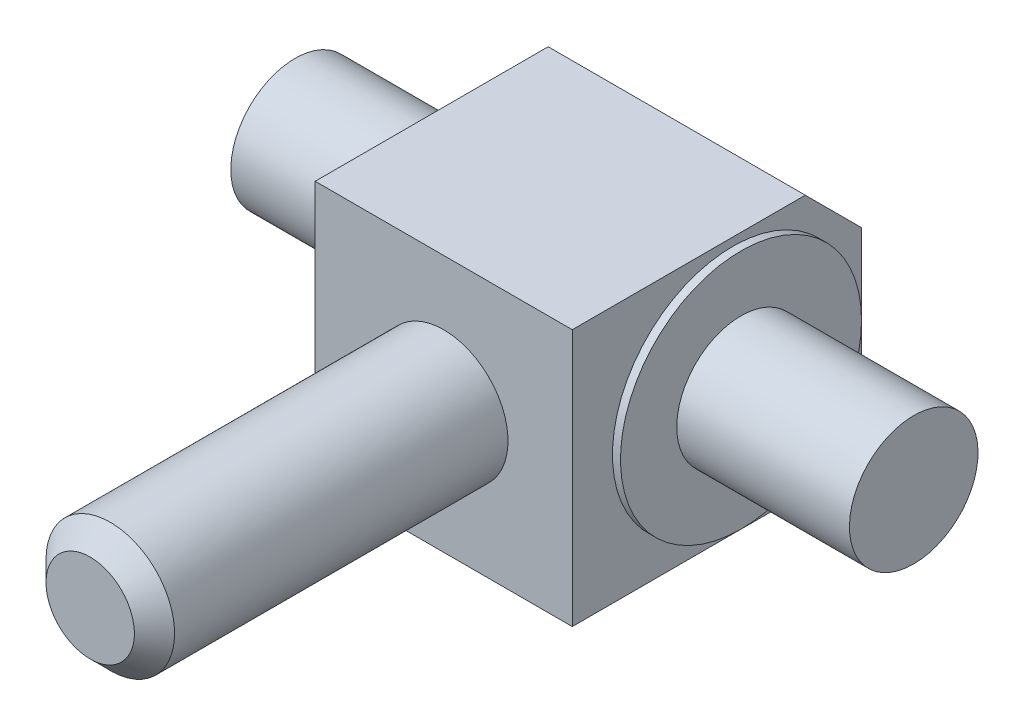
ISO-10303-21;
HEADER;
FILE_DESCRIPTION(('STEP AP214'),'2;1');
FILE_NAME('part.step','',(''),(''),'','','');
FILE_SCHEMA(('AUTOMOTIVE_DESIGN { 1 0 10303 214 1 1 1 1 }'));
ENDSEC;
DATA;
#1=APPLICATION_CONTEXT('core data for automotive mechanical design processes');
#2=APPLICATION_PROTOCOL_DEFINITION('international standard','automotive_design',2000,#1);
#3=PRODUCT_CONTEXT('',#1,'mechanical');
#4=PRODUCT('Part','Part','',(#3));
#5=PRODUCT_RELATED_PRODUCT_CATEGORY('part','',(#4));
#6=PRODUCT_DEFINITION_FORMATION('','',#4);
#7=PRODUCT_DEFINITION_CONTEXT('part definition',#1,'design');
#8=PRODUCT_DEFINITION('design','',#6,#7);
#9=PRODUCT_DEFINITION_SHAPE('','',#8);
#10=(LENGTH_UNIT() NAMED_UNIT(*) SI_UNIT(.MILLI.,.METRE.));
#11=(NAMED_UNIT(*) PLANE_ANGLE_UNIT() SI_UNIT($,.RADIAN.));
#12=(NAMED_UNIT(*) SI_UNIT($,.STERADIAN.) SOLID_ANGLE_UNIT());
#13=UNCERTAINTY_MEASURE_WITH_UNIT(LENGTH_MEASURE(1.E-05),#10,'distance_accuracy_value','');
#14=(GEOMETRIC_REPRESENTATION_CONTEXT(3) GLOBAL_UNCERTAINTY_ASSIGNED_CONTEXT((#13)) GLOBAL_UNIT_ASSIGNED_CONTEXT((#10,
#11,#12)) REPRESENTATION_CONTEXT('',''));
#15=CARTESIAN_POINT('',(0.,0.,0.));
#16=DIRECTION('',(0.,0.,1.));
#17=DIRECTION('',(1.,0.,0.));
#18=AXIS2_PLACEMENT_3D('',#15,#16,#17);
#19=CARTESIAN_POINT('',(8.,8.,-8.));
#20=DIRECTION('',(-1.,0.,0.));
#21=DIRECTION('',(0.,0.,-1.));
#22=AXIS2_PLACEMENT_3D('',#19,#20,#21);
#23=PLANE('',#22);
#24=DIRECTION('',(0.,-1.,0.));
#25=VECTOR('',#24,1.);
#26=CARTESIAN_POINT('',(8.,8.,-8.));
#27=LINE('',#26,#25);
#28=CARTESIAN_POINT('',(8.,4.5,-8.));
#29=VERTEX_POINT('',#28);
#30=CARTESIAN_POINT('',(8.,-4.5,-8.));
#31=VERTEX_POINT('',#30);
#32=EDGE_CURVE('E105',#29,#31,#27,.T.);
#33=ORIENTED_EDGE('',*,*,#32,.F.);
#34=DIRECTION('',(0.,0.707106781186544,0.707106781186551));
#35=VECTOR('',#34,1.);
#36=CARTESIAN_POINT('',(8.,8.,-4.5));
#37=LINE('',#36,#35);
#38=CARTESIAN_POINT('',(8.,8.,-4.5));
#39=VERTEX_POINT('',#38);
#40=EDGE_CURVE('E121',#29,#39,#37,.T.);
#41=ORIENTED_EDGE('',*,*,#40,.T.);
#42=DIRECTION('',(0.,0.,1.));
#43=VECTOR('',#42,1.);
#44=CARTESIAN_POINT('',(8.,8.,-8.));
#45=LINE('',#44,#43);
#46=CARTESIAN_POINT('',(8.,8.,10.));
#47=VERTEX_POINT('',#46);
#48=EDGE_CURVE('E79',#39,#47,#45,.T.);
#49=ORIENTED_EDGE('',*,*,#48,.T.);
#50=DIRECTION('',(0.,-1.,0.));
#51=VECTOR('',#50,1.);
#52=CARTESIAN_POINT('',(8.,8.,10.));
#53=LINE('',#52,#51);
#54=CARTESIAN_POINT('',(8.,-8.,10.));
#55=VERTEX_POINT('',#54);
#56=EDGE_CURVE('E95',#47,#55,#53,.T.);
#57=ORIENTED_EDGE('',*,*,#56,.T.);
#58=DIRECTION('',(0.,0.,1.));
#59=VECTOR('',#58,1.);
#60=CARTESIAN_POINT('',(8.,-8.,-8.));
#61=LINE('',#60,#59);
#62=CARTESIAN_POINT('',(8.,-8.,-4.5));
#63=VERTEX_POINT('',#62);
#64=EDGE_CURVE('E108',#63,#55,#61,.T.);
#65=ORIENTED_EDGE('',*,*,#64,.F.);
#66=DIRECTION('',(0.,0.707106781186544,-0.707106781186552));
#67=VECTOR('',#66,1.);
#68=CARTESIAN_POINT('',(8.,-8.,-4.5));
#69=LINE('',#68,#67);
#70=EDGE_CURVE('E29',#63,#31,#69,.T.);
#71=ORIENTED_EDGE('',*,*,#70,.T.);
#72=EDGE_LOOP('',(#33,#41,#49,#57,#65,#71));
#73=FACE_BOUND('',#72,.T.);
#74=CARTESIAN_POINT('',(8.,0.,0.));
#75=DIRECTION('',(-1.,0.,0.));
#76=DIRECTION('',(0.,0.,-1.));
#77=AXIS2_PLACEMENT_3D('',#74,#75,#76);
#78=CIRCLE('',#77,7.5);
#79=CARTESIAN_POINT('',(8.,0.,-7.5));
#80=VERTEX_POINT('',#79);
#81=EDGE_CURVE('E135',#80,#80,#78,.F.);
#82=ORIENTED_EDGE('',*,*,#81,.F.);
#83=EDGE_LOOP('',(#82));
#84=FACE_BOUND('',#83,.T.);
#85=ADVANCED_FACE('F14',(#73,#84),#23,.F.);
#86=CARTESIAN_POINT('',(-8.,-8.,-8.));
#87=DIRECTION('',(1.,0.,0.));
#88=DIRECTION('',(0.,1.,0.));
#89=AXIS2_PLACEMENT_3D('',#86,#87,#88);
#90=PLANE('',#89);
#91=DIRECTION('',(0.,0.,1.));
#92=VECTOR('',#91,1.);
#93=CARTESIAN_POINT('',(-8.,8.,-8.));
#94=LINE('',#93,#92);
#95=CARTESIAN_POINT('',(-8.,8.,-4.5));
#96=VERTEX_POINT('',#95);
#97=CARTESIAN_POINT('',(-8.,8.,10.));
#98=VERTEX_POINT('',#97);
#99=EDGE_CURVE('E69',#96,#98,#94,.T.);
#100=ORIENTED_EDGE('',*,*,#99,.F.);
#101=DIRECTION('',(0.,-0.707106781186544,-0.707106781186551));
#102=VECTOR('',#101,1.);
#103=CARTESIAN_POINT('',(-8.,8.,-4.5));
#104=LINE('',#103,#102);
#105=CARTESIAN_POINT('',(-8.,4.5,-8.));
#106=VERTEX_POINT('',#105);
#107=EDGE_CURVE('E114',#96,#106,#104,.T.);
#108=ORIENTED_EDGE('',*,*,#107,.T.);
#109=DIRECTION('',(0.,1.,0.));
#110=VECTOR('',#109,1.);
#111=CARTESIAN_POINT('',(-8.,-8.,-8.));
#112=LINE('',#111,#110);
#113=CARTESIAN_POINT('',(-8.,-4.5,-8.));
#114=VERTEX_POINT('',#113);
#115=EDGE_CURVE('E102',#114,#106,#112,.T.);
#116=ORIENTED_EDGE('',*,*,#115,.F.);
#117=DIRECTION('',(0.,-0.707106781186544,0.707106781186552));
#118=VECTOR('',#117,1.);
#119=CARTESIAN_POINT('',(-8.,-8.,-4.5));
#120=LINE('',#119,#118);
#121=CARTESIAN_POINT('',(-8.,-8.,-4.5));
#122=VERTEX_POINT('',#121);
#123=EDGE_CURVE('E112',#114,#122,#120,.T.);
#124=ORIENTED_EDGE('',*,*,#123,.T.);
#125=DIRECTION('',(0.,0.,1.));
#126=VECTOR('',#125,1.);
#127=CARTESIAN_POINT('',(-8.,-8.,-8.));
#128=LINE('',#127,#126);
#129=CARTESIAN_POINT('',(-8.,-8.,10.));
#130=VERTEX_POINT('',#129);
#131=EDGE_CURVE('E86',#122,#130,#128,.T.);
#132=ORIENTED_EDGE('',*,*,#131,.T.);
#133=DIRECTION('',(0.,1.,0.));
#134=VECTOR('',#133,1.);
#135=CARTESIAN_POINT('',(-8.,-8.,10.));
#136=LINE('',#135,#134);
#137=EDGE_CURVE('E82',#130,#98,#136,.T.);
#138=ORIENTED_EDGE('',*,*,#137,.T.);
#139=EDGE_LOOP('',(#100,#108,#116,#124,#132,#138));
#140=FACE_BOUND('',#139,.T.);
#141=CARTESIAN_POINT('',(-8.,0.,0.));
#142=DIRECTION('',(1.,0.,0.));
#143=DIRECTION('',(0.,1.,0.));
#144=AXIS2_PLACEMENT_3D('',#141,#142,#143);
#145=CIRCLE('',#144,7.5);
#146=CARTESIAN_POINT('',(-8.,7.49999999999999,0.));
#147=VERTEX_POINT('',#146);
#148=EDGE_CURVE('E128',#147,#147,#145,.F.);
#149=ORIENTED_EDGE('',*,*,#148,.F.);
#150=EDGE_LOOP('',(#149));
#151=FACE_BOUND('',#150,.T.);
#152=ADVANCED_FACE('F83',(#140,#151),#90,.F.);
#153=CARTESIAN_POINT('',(8.,8.,-8.));
#154=DIRECTION('',(0.,1.,0.));
#155=DIRECTION('',(0.,0.,-1.));
#156=AXIS2_PLACEMENT_3D('',#153,#154,#155);
#157=PLANE('',#156);
#158=ORIENTED_EDGE('',*,*,#48,.F.);
#159=DIRECTION('',(-1.,0.,0.));
#160=VECTOR('',#159,1.);
#161=CARTESIAN_POINT('',(-8.,8.,-4.5));
#162=LINE('',#161,#160);
#163=EDGE_CURVE('E77',#39,#96,#162,.T.);
#164=ORIENTED_EDGE('',*,*,#163,.T.);
#165=ORIENTED_EDGE('',*,*,#99,.T.);
#166=DIRECTION('',(-1.,0.,0.));
#167=VECTOR('',#166,1.);
#168=CARTESIAN_POINT('',(8.,8.,10.));
#169=LINE('',#168,#167);
#170=EDGE_CURVE('E74',#47,#98,#169,.T.);
#171=ORIENTED_EDGE('',*,*,#170,.F.);
#172=EDGE_LOOP('',(#158,#164,#165,#171));
#173=FACE_BOUND('',#172,.T.);
#174=ADVANCED_FACE('F72',(#173),#157,.T.);
#175=CARTESIAN_POINT('',(-8.,-8.,-8.));
#176=DIRECTION('',(0.,-1.,0.));
#177=DIRECTION('',(0.,0.,1.));
#178=AXIS2_PLACEMENT_3D('',#175,#176,#177);
#179=PLANE('',#178);
#180=ORIENTED_EDGE('',*,*,#131,.F.);
#181=DIRECTION('',(1.,0.,0.));
#182=VECTOR('',#181,1.);
#183=CARTESIAN_POINT('',(8.,-8.,-4.5));
#184=LINE('',#183,#182);
#185=EDGE_CURVE('E123',#122,#63,#184,.T.);
#186=ORIENTED_EDGE('',*,*,#185,.T.);
#187=ORIENTED_EDGE('',*,*,#64,.T.);
#188=DIRECTION('',(1.,0.,0.));
#189=VECTOR('',#188,1.);
#190=CARTESIAN_POINT('',(-8.,-8.,10.));
#191=LINE('',#190,#189);
#192=EDGE_CURVE('E97',#130,#55,#191,.T.);
#193=ORIENTED_EDGE('',*,*,#192,.F.);
#194=EDGE_LOOP('',(#180,#186,#187,#193));
#195=FACE_BOUND('',#194,.T.);
#196=ADVANCED_FACE('F158',(#195),#179,.T.);
#197=CARTESIAN_POINT('',(-8.,8.,-8.));
#198=DIRECTION('',(0.,0.,1.));
#199=DIRECTION('',(-1.,0.,0.));
#200=AXIS2_PLACEMENT_3D('',#197,#198,#199);
#201=PLANE('',#200);
#202=ORIENTED_EDGE('',*,*,#115,.T.);
#203=DIRECTION('',(1.,0.,0.));
#204=VECTOR('',#203,1.);
#205=CARTESIAN_POINT('',(8.,4.5,-8.));
#206=LINE('',#205,#204);
#207=EDGE_CURVE('E118',#106,#29,#206,.T.);
#208=ORIENTED_EDGE('',*,*,#207,.T.);
#209=ORIENTED_EDGE('',*,*,#32,.T.);
#210=DIRECTION('',(-1.,0.,0.));
#211=VECTOR('',#210,1.);
#212=CARTESIAN_POINT('',(-8.,-4.5,-8.));
#213=LINE('',#212,#211);
#214=EDGE_CURVE('E116',#31,#114,#213,.T.);
#215=ORIENTED_EDGE('',*,*,#214,.T.);
#216=EDGE_LOOP('',(#202,#208,#209,#215));
#217=FACE_BOUND('',#216,.T.);
#218=ADVANCED_FACE('F156',(#217),#201,.F.);
#219=CARTESIAN_POINT('',(-8.,8.,10.));
#220=DIRECTION('',(0.,0.,1.));
#221=DIRECTION('',(-1.,0.,0.));
#222=AXIS2_PLACEMENT_3D('',#219,#220,#221);
#223=PLANE('',#222);
#224=ORIENTED_EDGE('',*,*,#137,.F.);
#225=ORIENTED_EDGE('',*,*,#192,.T.);
#226=ORIENTED_EDGE('',*,*,#56,.F.);
#227=ORIENTED_EDGE('',*,*,#170,.T.);
#228=EDGE_LOOP('',(#224,#225,#226,#227));
#229=FACE_BOUND('',#228,.T.);
#230=CARTESIAN_POINT('',(0.,0.,10.));
#231=DIRECTION('',(0.,0.,1.));
#232=DIRECTION('',(-1.,0.,0.));
#233=AXIS2_PLACEMENT_3D('',#230,#231,#232);
#234=CIRCLE('',#233,4.);
#235=CARTESIAN_POINT('',(-4.,0.,10.));
#236=VERTEX_POINT('',#235);
#237=EDGE_CURVE('E90',#236,#236,#234,.T.);
#238=ORIENTED_EDGE('',*,*,#237,.F.);
#239=EDGE_LOOP('',(#238));
#240=FACE_BOUND('',#239,.T.);
#241=ADVANCED_FACE('F92',(#229,#240),#223,.T.);
#242=CARTESIAN_POINT('',(8.,8.,-4.5));
#243=DIRECTION('',(0.,0.707106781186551,-0.707106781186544));
#244=DIRECTION('',(0.,-0.707106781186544,-0.707106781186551));
#245=AXIS2_PLACEMENT_3D('',#242,#243,#244);
#246=PLANE('',#245);
#247=ORIENTED_EDGE('',*,*,#40,.F.);
#248=ORIENTED_EDGE('',*,*,#207,.F.);
#249=ORIENTED_EDGE('',*,*,#107,.F.);
#250=ORIENTED_EDGE('',*,*,#163,.F.);
#251=EDGE_LOOP('',(#247,#248,#249,#250));
#252=FACE_BOUND('',#251,.T.);
#253=ADVANCED_FACE('F155',(#252),#246,.T.);
#254=CARTESIAN_POINT('',(-8.,-8.,-4.5));
#255=DIRECTION('',(0.,-0.707106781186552,-0.707106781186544));
#256=DIRECTION('',(0.,-0.707106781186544,0.707106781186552));
#257=AXIS2_PLACEMENT_3D('',#254,#255,#256);
#258=PLANE('',#257);
#259=ORIENTED_EDGE('',*,*,#123,.F.);
#260=ORIENTED_EDGE('',*,*,#214,.F.);
#261=ORIENTED_EDGE('',*,*,#70,.F.);
#262=ORIENTED_EDGE('',*,*,#185,.F.);
#263=EDGE_LOOP('',(#259,#260,#261,#262));
#264=FACE_BOUND('',#263,.T.);
#265=ADVANCED_FACE('F165',(#264),#258,.T.);
#266=CARTESIAN_POINT('',(0.,0.,32.));
#267=DIRECTION('',(0.,0.,1.));
#268=DIRECTION('',(-1.,0.,0.));
#269=AXIS2_PLACEMENT_3D('',#266,#267,#268);
#270=PLANE('',#269);
#271=CARTESIAN_POINT('',(0.,0.,32.));
#272=DIRECTION('',(0.,0.,1.));
#273=DIRECTION('',(-1.,0.,0.));
#274=AXIS2_PLACEMENT_3D('',#271,#272,#273);
#275=CIRCLE('',#274,2.75);
#276=CARTESIAN_POINT('',(-2.75,0.,32.));
#277=VERTEX_POINT('',#276);
#278=EDGE_CURVE('E22',#277,#277,#275,.T.);
#279=ORIENTED_EDGE('',*,*,#278,.T.);
#280=EDGE_LOOP('',(#279));
#281=FACE_BOUND('',#280,.T.);
#282=ADVANCED_FACE('F184',(#281),#270,.T.);
#283=CARTESIAN_POINT('',(0.,0.,32.));
#284=DIRECTION('',(0.,0.,-1.));
#285=DIRECTION('',(1.,0.,0.));
#286=AXIS2_PLACEMENT_3D('',#283,#284,#285);
#287=CYLINDRICAL_SURFACE('',#286,4.);
#288=CARTESIAN_POINT('',(0.,0.,30.75));
#289=DIRECTION('',(0.,0.,1.));
#290=DIRECTION('',(-1.,0.,0.));
#291=AXIS2_PLACEMENT_3D('',#288,#289,#290);
#292=CIRCLE('',#291,4.);
#293=CARTESIAN_POINT('',(-4.,0.,30.75));
#294=VERTEX_POINT('',#293);
#295=EDGE_CURVE('E9',#294,#294,#292,.F.);
#296=ORIENTED_EDGE('',*,*,#295,.T.);
#297=EDGE_LOOP('',(#296));
#298=FACE_BOUND('',#297,.T.);
#299=ORIENTED_EDGE('',*,*,#237,.T.);
#300=EDGE_LOOP('',(#299));
#301=FACE_BOUND('',#300,.T.);
#302=ADVANCED_FACE('F153',(#298,#301),#287,.T.);
#303=CARTESIAN_POINT('',(8.5,0.,0.));
#304=DIRECTION('',(-1.,0.,0.));
#305=DIRECTION('',(0.,-1.,0.));
#306=AXIS2_PLACEMENT_3D('',#303,#304,#305);
#307=PLANE('',#306);
#308=CARTESIAN_POINT('',(8.5,0.,0.));
#309=DIRECTION('',(-1.,0.,0.));
#310=DIRECTION('',(0.,-1.,0.));
#311=AXIS2_PLACEMENT_3D('',#308,#309,#310);
#312=CIRCLE('',#311,7.5);
#313=CARTESIAN_POINT('',(8.5,-7.5,0.));
#314=VERTEX_POINT('',#313);
#315=EDGE_CURVE('E250',#314,#314,#312,.T.);
#316=ORIENTED_EDGE('',*,*,#315,.F.);
#317=EDGE_LOOP('',(#316));
#318=FACE_BOUND('',#317,.T.);
#319=CARTESIAN_POINT('',(8.5,0.,0.));
#320=DIRECTION('',(-1.,0.,0.));
#321=DIRECTION('',(0.,-1.,0.));
#322=AXIS2_PLACEMENT_3D('',#319,#320,#321);
#323=CIRCLE('',#322,4.);
#324=CARTESIAN_POINT('',(8.5,-4.,0.));
#325=VERTEX_POINT('',#324);
#326=EDGE_CURVE('E125',#325,#325,#323,.T.);
#327=ORIENTED_EDGE('',*,*,#326,.T.);
#328=EDGE_LOOP('',(#327));
#329=FACE_BOUND('',#328,.T.);
#330=ADVANCED_FACE('F187',(#318,#329),#307,.F.);
#331=CARTESIAN_POINT('',(-8.5,0.,0.));
#332=DIRECTION('',(1.,0.,0.));
#333=DIRECTION('',(0.,1.,0.));
#334=AXIS2_PLACEMENT_3D('',#331,#332,#333);
#335=CYLINDRICAL_SURFACE('',#334,7.5);
#336=ORIENTED_EDGE('',*,*,#315,.T.);
#337=EDGE_LOOP('',(#336));
#338=FACE_BOUND('',#337,.T.);
#339=ORIENTED_EDGE('',*,*,#81,.T.);
#340=EDGE_LOOP('',(#339));
#341=FACE_BOUND('',#340,.T.);
#342=ADVANCED_FACE('F193',(#338,#341),#335,.T.);
#343=CARTESIAN_POINT('',(19.25,0.,0.));
#344=DIRECTION('',(-1.,0.,0.));
#345=DIRECTION('',(0.,-1.,0.));
#346=AXIS2_PLACEMENT_3D('',#343,#344,#345);
#347=PLANE('',#346);
#348=CARTESIAN_POINT('',(19.25,0.,0.));
#349=DIRECTION('',(-1.,0.,0.));
#350=DIRECTION('',(0.,-1.,0.));
#351=AXIS2_PLACEMENT_3D('',#348,#349,#350);
#352=CIRCLE('',#351,4.);
#353=CARTESIAN_POINT('',(19.25,-4.,0.));
#354=VERTEX_POINT('',#353);
#355=EDGE_CURVE('E132',#354,#354,#352,.T.);
#356=ORIENTED_EDGE('',*,*,#355,.F.);
#357=EDGE_LOOP('',(#356));
#358=FACE_BOUND('',#357,.T.);
#359=ADVANCED_FACE('F220',(#358),#347,.F.);
#360=CARTESIAN_POINT('',(-19.25,0.,0.));
#361=DIRECTION('',(1.,0.,0.));
#362=DIRECTION('',(0.,1.,0.));
#363=AXIS2_PLACEMENT_3D('',#360,#361,#362);
#364=CYLINDRICAL_SURFACE('',#363,4.);
#365=ORIENTED_EDGE('',*,*,#355,.T.);
#366=EDGE_LOOP('',(#365));
#367=FACE_BOUND('',#366,.T.);
#368=ORIENTED_EDGE('',*,*,#326,.F.);
#369=EDGE_LOOP('',(#368));
#370=FACE_BOUND('',#369,.T.);
#371=ADVANCED_FACE('F208',(#367,#370),#364,.T.);
#372=CARTESIAN_POINT('',(-8.5,0.,0.));
#373=DIRECTION('',(-1.,0.,0.));
#374=DIRECTION('',(0.,-1.,0.));
#375=AXIS2_PLACEMENT_3D('',#372,#373,#374);
#376=CIRCLE('',#375,7.5);
#377=CARTESIAN_POINT('',(-8.5,-7.50000000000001,0.));
#378=VERTEX_POINT('',#377);
#379=EDGE_CURVE('E133',#378,#378,#376,.T.);
#380=ORIENTED_EDGE('',*,*,#379,.F.);
#381=EDGE_LOOP('',(#380));
#382=FACE_BOUND('',#381,.T.);
#383=ORIENTED_EDGE('',*,*,#148,.T.);
#384=EDGE_LOOP('',(#383));
#385=FACE_BOUND('',#384,.T.);
#386=ADVANCED_FACE('F219',(#382,#385),#335,.T.);
#387=CARTESIAN_POINT('',(-8.5,0.,0.));
#388=DIRECTION('',(-1.,0.,0.));
#389=DIRECTION('',(0.,-1.,0.));
#390=AXIS2_PLACEMENT_3D('',#387,#388,#389);
#391=PLANE('',#390);
#392=ORIENTED_EDGE('',*,*,#379,.T.);
#393=EDGE_LOOP('',(#392));
#394=FACE_BOUND('',#393,.T.);
#395=CARTESIAN_POINT('',(-8.5,0.,0.));
#396=DIRECTION('',(-1.,0.,0.));
#397=DIRECTION('',(0.,-1.,0.));
#398=AXIS2_PLACEMENT_3D('',#395,#396,#397);
#399=CIRCLE('',#398,4.);
#400=CARTESIAN_POINT('',(-8.5,-4.00000000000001,0.));
#401=VERTEX_POINT('',#400);
#402=EDGE_CURVE('E129',#401,#401,#399,.T.);
#403=ORIENTED_EDGE('',*,*,#402,.F.);
#404=EDGE_LOOP('',(#403));
#405=FACE_BOUND('',#404,.T.);
#406=ADVANCED_FACE('F213',(#394,#405),#391,.T.);
#407=CARTESIAN_POINT('',(-19.25,0.,0.));
#408=DIRECTION('',(-1.,0.,0.));
#409=DIRECTION('',(0.,-1.,0.));
#410=AXIS2_PLACEMENT_3D('',#407,#408,#409);
#411=PLANE('',#410);
#412=CARTESIAN_POINT('',(-19.25,0.,0.));
#413=DIRECTION('',(-1.,0.,0.));
#414=DIRECTION('',(0.,-1.,0.));
#415=AXIS2_PLACEMENT_3D('',#412,#413,#414);
#416=CIRCLE('',#415,4.);
#417=CARTESIAN_POINT('',(-19.25,-4.00000000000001,0.));
#418=VERTEX_POINT('',#417);
#419=EDGE_CURVE('E148',#418,#418,#416,.T.);
#420=ORIENTED_EDGE('',*,*,#419,.T.);
#421=EDGE_LOOP('',(#420));
#422=FACE_BOUND('',#421,.T.);
#423=ADVANCED_FACE('F205',(#422),#411,.T.);
#424=ORIENTED_EDGE('',*,*,#402,.T.);
#425=EDGE_LOOP('',(#424));
#426=FACE_BOUND('',#425,.T.);
#427=ORIENTED_EDGE('',*,*,#419,.F.);
#428=EDGE_LOOP('',(#427));
#429=FACE_BOUND('',#428,.T.);
#430=ADVANCED_FACE('F200',(#426,#429),#364,.T.);
#431=CARTESIAN_POINT('',(0.,0.,32.));
#432=DIRECTION('',(0.,0.,-1.));
#433=DIRECTION('',(1.,0.,0.));
#434=AXIS2_PLACEMENT_3D('',#431,#432,#433);
#435=CONICAL_SURFACE('',#434,2.75,0.785398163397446);
#436=ORIENTED_EDGE('',*,*,#295,.F.);
#437=EDGE_LOOP('',(#436));
#438=FACE_BOUND('',#437,.T.);
#439=ORIENTED_EDGE('',*,*,#278,.F.);
#440=EDGE_LOOP('',(#439));
#441=FACE_BOUND('',#440,.T.);
#442=ADVANCED_FACE('F16',(#438,#441),#435,.T.);
#443=CLOSED_SHELL('',(#85,#152,#174,#196,#218,#241,#253,#265,#282,#302,#330,#342,#359,#371,#386,
#406,#423,#430,#442));
#444=MANIFOLD_SOLID_BREP('B1',#443);
#445=ADVANCED_BREP_SHAPE_REPRESENTATION('',(#18,#444),#14);
#446=SHAPE_DEFINITION_REPRESENTATION(#9,#445);
ENDSEC;
END-ISO-10303-21;
